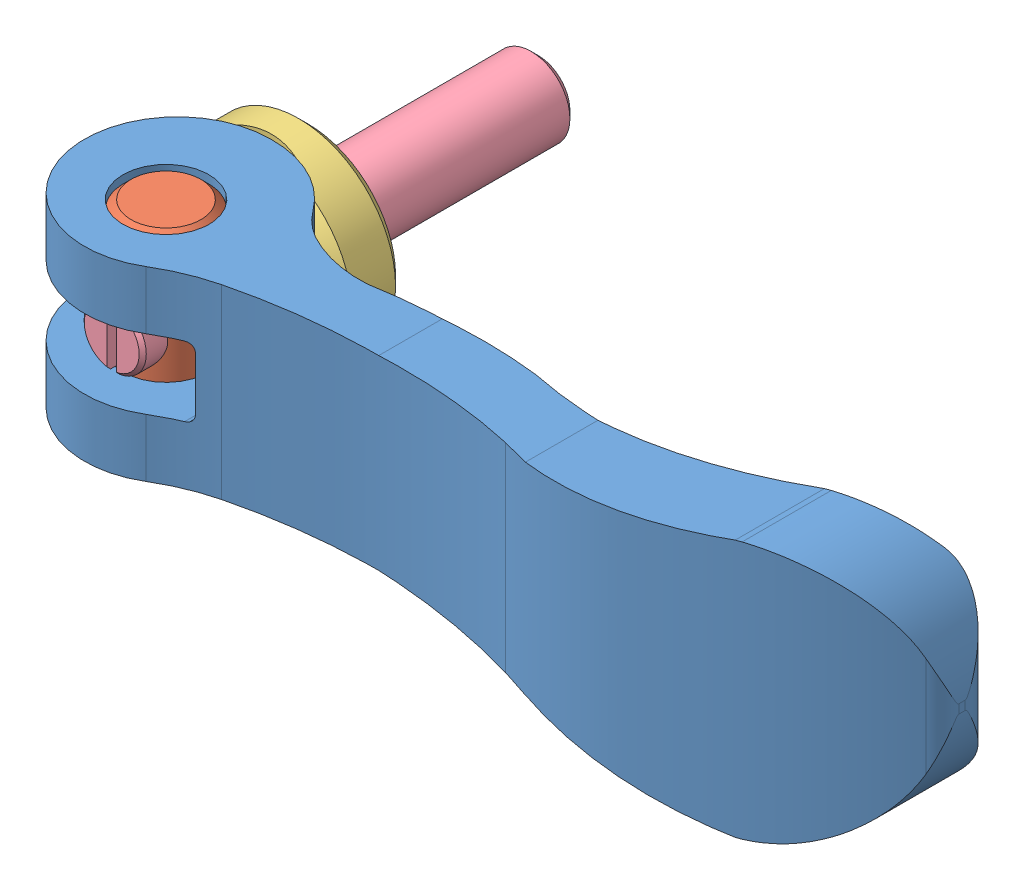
SolidWorks assembly KCL10X30-SUS.SLDASM, configuration Default (file format 15000). Lengths in mm.
Overall size (108.51 33.22 58.5).
4 component instances, 4 part files, 0 mates.
Components (placement in the parent):
- KCL10X30-SUS_01-1: KCL10X30-SUS_01.SLDPRT [ﾃﾞﾌｫﾙﾄ] at (0 0 18.3) x (1 0 0) z (0 -1 0) size (108.01 24 33.22)
- KCL10X30-SUS_02-1: KCL10X30-SUS_02.SLDPRT [ﾃﾞﾌｫﾙﾄ] at (0 0 18.3) x (0 1 0) z (1 0 0) size (24 11 11)
- KCL10X30-SUS_03-1: KCL10X30-SUS_03.SLDPRT [ﾃﾞﾌｫﾙﾄ] x (1 0 0) z (0 -1 0) size (25 8 25)
- KCL10X30-SUS_04-1: KCL10X30-SUS_04.SLDPRT [ﾃﾞﾌｫﾙﾄ] at (0 0 -24.7) x (0 1 0) z (1 0 0) size (10 55 10)
